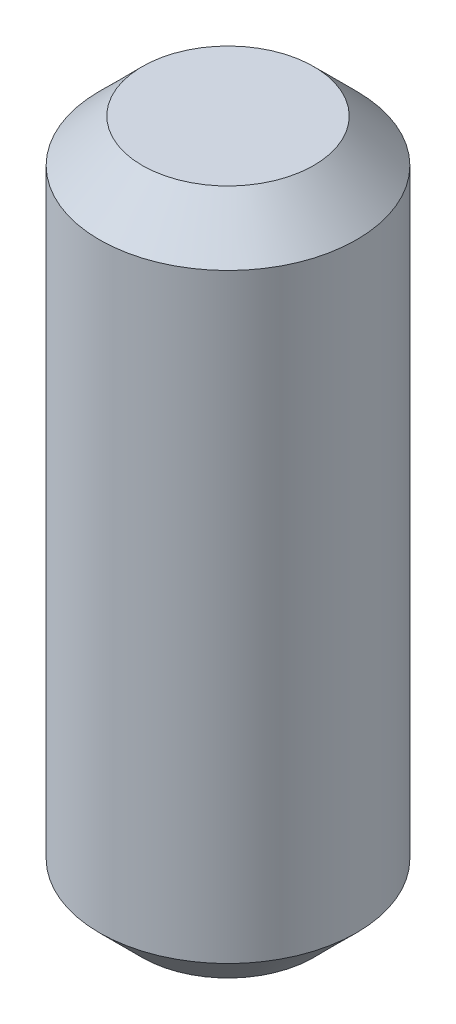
ISO-10303-21;
HEADER;
FILE_DESCRIPTION(('STEP AP214'),'2;1');
FILE_NAME('part.step','',(''),(''),'','','');
FILE_SCHEMA(('AUTOMOTIVE_DESIGN { 1 0 10303 214 1 1 1 1 }'));
ENDSEC;
DATA;
#1=APPLICATION_CONTEXT('core data for automotive mechanical design processes');
#2=APPLICATION_PROTOCOL_DEFINITION('international standard','automotive_design',2000,#1);
#3=PRODUCT_CONTEXT('',#1,'mechanical');
#4=PRODUCT('Part','Part','',(#3));
#5=PRODUCT_RELATED_PRODUCT_CATEGORY('part','',(#4));
#6=PRODUCT_DEFINITION_FORMATION('','',#4);
#7=PRODUCT_DEFINITION_CONTEXT('part definition',#1,'design');
#8=PRODUCT_DEFINITION('design','',#6,#7);
#9=PRODUCT_DEFINITION_SHAPE('','',#8);
#10=(LENGTH_UNIT() NAMED_UNIT(*) SI_UNIT(.MILLI.,.METRE.));
#11=(NAMED_UNIT(*) PLANE_ANGLE_UNIT() SI_UNIT($,.RADIAN.));
#12=(NAMED_UNIT(*) SI_UNIT($,.STERADIAN.) SOLID_ANGLE_UNIT());
#13=UNCERTAINTY_MEASURE_WITH_UNIT(LENGTH_MEASURE(1.E-05),#10,'distance_accuracy_value','');
#14=(GEOMETRIC_REPRESENTATION_CONTEXT(3) GLOBAL_UNCERTAINTY_ASSIGNED_CONTEXT((#13)) GLOBAL_UNIT_ASSIGNED_CONTEXT((#10,
#11,#12)) REPRESENTATION_CONTEXT('',''));
#15=CARTESIAN_POINT('',(0.,0.,0.));
#16=DIRECTION('',(0.,0.,1.));
#17=DIRECTION('',(1.,0.,0.));
#18=AXIS2_PLACEMENT_3D('',#15,#16,#17);
#19=CARTESIAN_POINT('',(0.,8.00000000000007,0.));
#20=DIRECTION('',(0.,-1.00000000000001,0.));
#21=DIRECTION('',(0.,0.,-1.));
#22=AXIS2_PLACEMENT_3D('',#19,#20,#21);
#23=CYLINDRICAL_SURFACE('',#22,1.5);
#24=CARTESIAN_POINT('',(0.,7.50000000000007,0.));
#25=DIRECTION('',(0.,1.00000000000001,0.));
#26=DIRECTION('',(0.,0.,1.));
#27=AXIS2_PLACEMENT_3D('',#24,#25,#26);
#28=CIRCLE('',#27,1.5);
#29=CARTESIAN_POINT('',(0.,7.50000000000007,1.5));
#30=VERTEX_POINT('',#29);
#31=EDGE_CURVE('E57',#30,#30,#28,.F.);
#32=ORIENTED_EDGE('',*,*,#31,.T.);
#33=EDGE_LOOP('',(#32));
#34=FACE_BOUND('',#33,.T.);
#35=CARTESIAN_POINT('',(0.,0.500000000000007,0.));
#36=DIRECTION('',(0.,1.00000000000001,0.));
#37=DIRECTION('',(0.,0.,1.));
#38=AXIS2_PLACEMENT_3D('',#35,#36,#37);
#39=CIRCLE('',#38,1.5);
#40=CARTESIAN_POINT('',(0.,0.500000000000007,1.5));
#41=VERTEX_POINT('',#40);
#42=EDGE_CURVE('E61',#41,#41,#39,.T.);
#43=ORIENTED_EDGE('',*,*,#42,.T.);
#44=EDGE_LOOP('',(#43));
#45=FACE_BOUND('',#44,.T.);
#46=ADVANCED_FACE('F50',(#34,#45),#23,.T.);
#47=CARTESIAN_POINT('',(0.,8.00000000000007,0.));
#48=DIRECTION('',(0.,1.00000000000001,0.));
#49=DIRECTION('',(0.,0.,1.));
#50=AXIS2_PLACEMENT_3D('',#47,#48,#49);
#51=PLANE('',#50);
#52=CARTESIAN_POINT('',(0.,8.00000000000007,0.));
#53=DIRECTION('',(0.,1.00000000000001,0.));
#54=DIRECTION('',(0.,0.,1.));
#55=AXIS2_PLACEMENT_3D('',#52,#53,#54);
#56=CIRCLE('',#55,0.999999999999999);
#57=CARTESIAN_POINT('',(0.,8.00000000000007,0.999999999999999));
#58=VERTEX_POINT('',#57);
#59=EDGE_CURVE('E65',#58,#58,#56,.T.);
#60=ORIENTED_EDGE('',*,*,#59,.T.);
#61=EDGE_LOOP('',(#60));
#62=FACE_BOUND('',#61,.T.);
#63=ADVANCED_FACE('F71',(#62),#51,.T.);
#64=CARTESIAN_POINT('',(0.,0.,0.));
#65=DIRECTION('',(0.,1.00000000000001,0.));
#66=DIRECTION('',(0.,0.,1.));
#67=AXIS2_PLACEMENT_3D('',#64,#65,#66);
#68=PLANE('',#67);
#69=CARTESIAN_POINT('',(0.,0.,0.));
#70=DIRECTION('',(0.,1.00000000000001,0.));
#71=DIRECTION('',(0.,0.,1.));
#72=AXIS2_PLACEMENT_3D('',#69,#70,#71);
#73=CIRCLE('',#72,0.999999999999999);
#74=CARTESIAN_POINT('',(0.,0.,0.999999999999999));
#75=VERTEX_POINT('',#74);
#76=EDGE_CURVE('E12',#75,#75,#73,.F.);
#77=ORIENTED_EDGE('',*,*,#76,.T.);
#78=EDGE_LOOP('',(#77));
#79=FACE_BOUND('',#78,.T.);
#80=ADVANCED_FACE('F75',(#79),#68,.F.);
#81=CARTESIAN_POINT('',(0.,8.00000000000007,0.));
#82=DIRECTION('',(0.,-1.00000000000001,0.));
#83=DIRECTION('',(0.,0.,-1.));
#84=AXIS2_PLACEMENT_3D('',#81,#82,#83);
#85=CONICAL_SURFACE('',#84,0.999999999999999,0.785398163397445);
#86=ORIENTED_EDGE('',*,*,#31,.F.);
#87=EDGE_LOOP('',(#86));
#88=FACE_BOUND('',#87,.T.);
#89=ORIENTED_EDGE('',*,*,#59,.F.);
#90=EDGE_LOOP('',(#89));
#91=FACE_BOUND('',#90,.T.);
#92=ADVANCED_FACE('F73',(#88,#91),#85,.T.);
#93=CARTESIAN_POINT('',(0.,0.500000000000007,0.));
#94=DIRECTION('',(0.,1.00000000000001,0.));
#95=DIRECTION('',(0.,0.,1.));
#96=AXIS2_PLACEMENT_3D('',#93,#94,#95);
#97=CONICAL_SURFACE('',#96,1.5,0.785398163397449);
#98=ORIENTED_EDGE('',*,*,#76,.F.);
#99=EDGE_LOOP('',(#98));
#100=FACE_BOUND('',#99,.T.);
#101=ORIENTED_EDGE('',*,*,#42,.F.);
#102=EDGE_LOOP('',(#101));
#103=FACE_BOUND('',#102,.T.);
#104=ADVANCED_FACE('F52',(#100,#103),#97,.T.);
#105=CLOSED_SHELL('',(#46,#63,#80,#92,#104));
#106=MANIFOLD_SOLID_BREP('B2',#105);
#107=ADVANCED_BREP_SHAPE_REPRESENTATION('',(#18,#106),#14);
#108=SHAPE_DEFINITION_REPRESENTATION(#9,#107);
ENDSEC;
END-ISO-10303-21;
